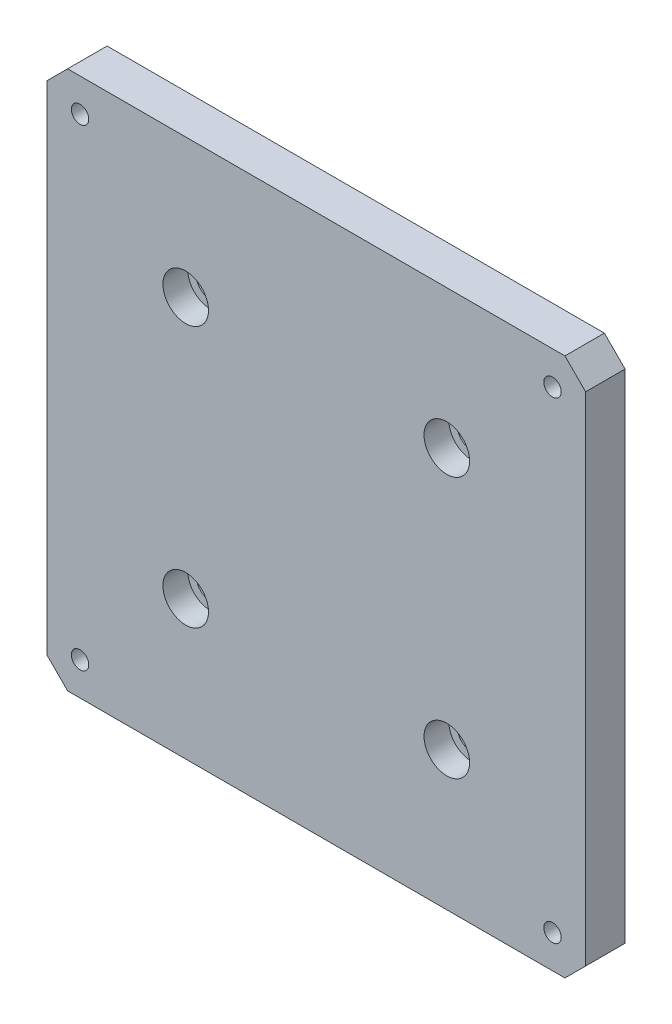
from build123d import *

# Parameters (mm, degrees)
SKETCH2_W                      = 130
SKETCH2_H                      = 130
BOSS_EXTRUDE1_DEPTH            = 4.7625
CHAMFER1_SIZE                  = 5
TAP_DRILL_FOR_M5X0_8_TAP1_D    = 4.2
CBORE_FOR_M6_SHCS1_D           = 7
CBORE_FOR_M6_SHCS1_CBORE_D     = 11
CBORE_FOR_M6_SHCS1_CBORE_DEPTH = 6


with BuildPart() as part:
    # Sketch2 → Boss-Extrude1 (new, symmetric)
    with BuildSketch(Plane.XY):
        Rectangle(SKETCH2_W, SKETCH2_H)
    extrude(amount=BOSS_EXTRUDE1_DEPTH, both=True)

    # Chamfer1
    chamfer1_edges = [part.edges().sort_by_distance(p)[0] for p in [
        (-65, -65, 0),
        (-65, 65, 0),
        (65, 65, 0),
        (65, -65, 0),
    ]]
    chamfer(chamfer1_edges, length=CHAMFER1_SIZE)

    # Tap Drill for M5x0.8 Tap1 (through all)
    with Locations(Plane.XY.offset(4.7625)):
        with Locations((-57, 57), (57, 57), (-57, -57), (57, -57)):
            Hole(TAP_DRILL_FOR_M5X0_8_TAP1_D / 2)

    # CBORE for M6 SHCS1 (through all)
    with Locations(Plane.XY.offset(4.7625)):
        with Locations((-31.5, 31.5), (31.5, 31.5), (31.5, -31.5), (-31.5, -31.5)):
            CounterBoreHole(CBORE_FOR_M6_SHCS1_D / 2, CBORE_FOR_M6_SHCS1_CBORE_D / 2, CBORE_FOR_M6_SHCS1_CBORE_DEPTH)


solid = part.part
